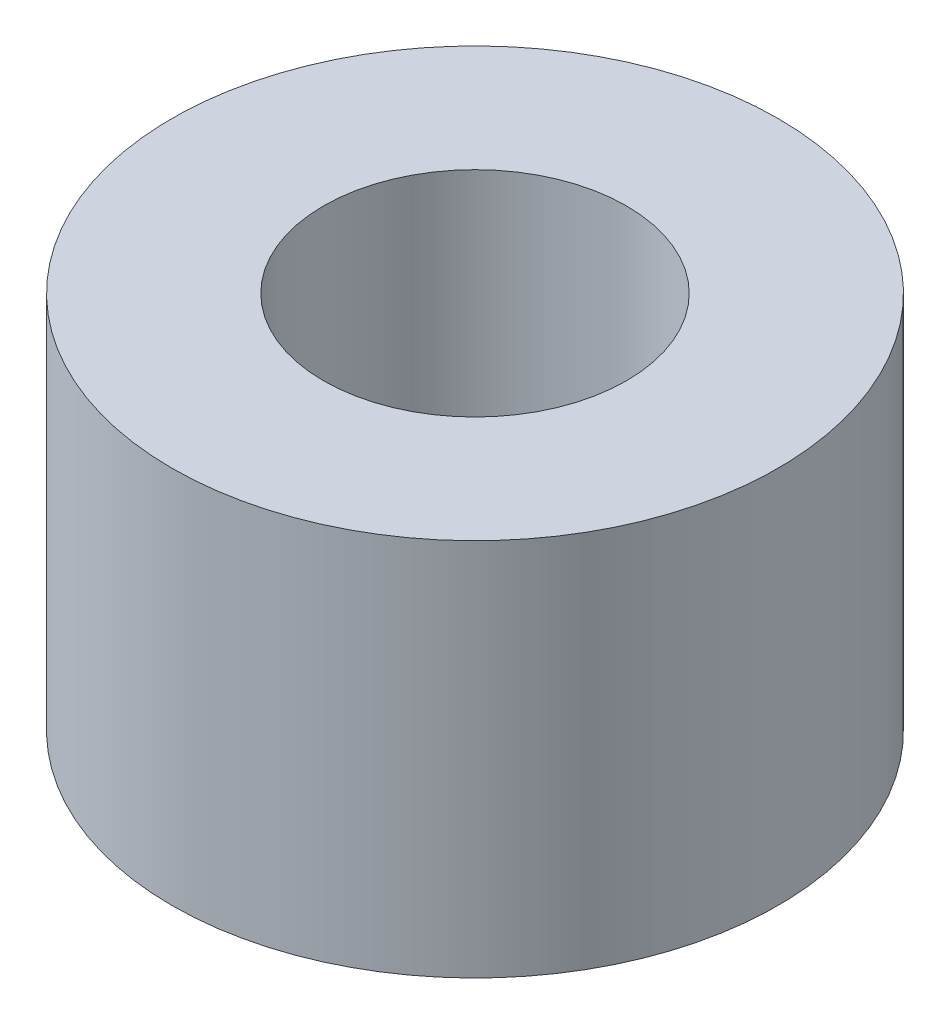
ISO-10303-21;
HEADER;
FILE_DESCRIPTION(('STEP AP214'),'2;1');
FILE_NAME('part.step','',(''),(''),'','','');
FILE_SCHEMA(('AUTOMOTIVE_DESIGN { 1 0 10303 214 1 1 1 1 }'));
ENDSEC;
DATA;
#1=APPLICATION_CONTEXT('core data for automotive mechanical design processes');
#2=APPLICATION_PROTOCOL_DEFINITION('international standard','automotive_design',2000,#1);
#3=PRODUCT_CONTEXT('',#1,'mechanical');
#4=PRODUCT('Part','Part','',(#3));
#5=PRODUCT_RELATED_PRODUCT_CATEGORY('part','',(#4));
#6=PRODUCT_DEFINITION_FORMATION('','',#4);
#7=PRODUCT_DEFINITION_CONTEXT('part definition',#1,'design');
#8=PRODUCT_DEFINITION('design','',#6,#7);
#9=PRODUCT_DEFINITION_SHAPE('','',#8);
#10=(LENGTH_UNIT() NAMED_UNIT(*) SI_UNIT(.MILLI.,.METRE.));
#11=(NAMED_UNIT(*) PLANE_ANGLE_UNIT() SI_UNIT($,.RADIAN.));
#12=(NAMED_UNIT(*) SI_UNIT($,.STERADIAN.) SOLID_ANGLE_UNIT());
#13=UNCERTAINTY_MEASURE_WITH_UNIT(LENGTH_MEASURE(1.E-05),#10,'distance_accuracy_value','');
#14=(GEOMETRIC_REPRESENTATION_CONTEXT(3) GLOBAL_UNCERTAINTY_ASSIGNED_CONTEXT((#13)) GLOBAL_UNIT_ASSIGNED_CONTEXT((#10,
#11,#12)) REPRESENTATION_CONTEXT('',''));
#15=CARTESIAN_POINT('',(0.,0.,0.));
#16=DIRECTION('',(0.,0.,1.));
#17=DIRECTION('',(1.,0.,0.));
#18=AXIS2_PLACEMENT_3D('',#15,#16,#17);
#19=CARTESIAN_POINT('',(0.,3.175,0.));
#20=DIRECTION('',(0.,1.,0.));
#21=DIRECTION('',(0.,0.,1.));
#22=AXIS2_PLACEMENT_3D('',#19,#20,#21);
#23=PLANE('',#22);
#24=CARTESIAN_POINT('',(0.,3.175,0.));
#25=DIRECTION('',(0.,1.,0.));
#26=DIRECTION('',(0.,0.,1.));
#27=AXIS2_PLACEMENT_3D('',#24,#25,#26);
#28=CIRCLE('',#27,2.54);
#29=CARTESIAN_POINT('',(0.,3.175,2.54));
#30=VERTEX_POINT('',#29);
#31=EDGE_CURVE('E10',#30,#30,#28,.T.);
#32=ORIENTED_EDGE('',*,*,#31,.T.);
#33=EDGE_LOOP('',(#32));
#34=FACE_BOUND('',#33,.T.);
#35=CARTESIAN_POINT('',(0.,3.175,0.));
#36=DIRECTION('',(0.,1.,0.));
#37=DIRECTION('',(0.,0.,1.));
#38=AXIS2_PLACEMENT_3D('',#35,#36,#37);
#39=CIRCLE('',#38,1.27);
#40=CARTESIAN_POINT('',(0.,3.175,1.27));
#41=VERTEX_POINT('',#40);
#42=EDGE_CURVE('E43',#41,#41,#39,.T.);
#43=ORIENTED_EDGE('',*,*,#42,.F.);
#44=EDGE_LOOP('',(#43));
#45=FACE_BOUND('',#44,.T.);
#46=ADVANCED_FACE('F32',(#34,#45),#23,.T.);
#47=CARTESIAN_POINT('',(0.,0.,0.));
#48=DIRECTION('',(0.,1.,0.));
#49=DIRECTION('',(0.,0.,1.));
#50=AXIS2_PLACEMENT_3D('',#47,#48,#49);
#51=PLANE('',#50);
#52=CARTESIAN_POINT('',(0.,0.,0.));
#53=DIRECTION('',(0.,1.,0.));
#54=DIRECTION('',(0.,0.,1.));
#55=AXIS2_PLACEMENT_3D('',#52,#53,#54);
#56=CIRCLE('',#55,2.54);
#57=CARTESIAN_POINT('',(0.,0.,2.54));
#58=VERTEX_POINT('',#57);
#59=EDGE_CURVE('E36',#58,#58,#56,.T.);
#60=ORIENTED_EDGE('',*,*,#59,.F.);
#61=EDGE_LOOP('',(#60));
#62=FACE_BOUND('',#61,.T.);
#63=CARTESIAN_POINT('',(0.,0.,0.));
#64=DIRECTION('',(0.,1.,0.));
#65=DIRECTION('',(0.,0.,1.));
#66=AXIS2_PLACEMENT_3D('',#63,#64,#65);
#67=CIRCLE('',#66,1.27);
#68=CARTESIAN_POINT('',(0.,0.,1.27));
#69=VERTEX_POINT('',#68);
#70=EDGE_CURVE('E45',#69,#69,#67,.T.);
#71=ORIENTED_EDGE('',*,*,#70,.T.);
#72=EDGE_LOOP('',(#71));
#73=FACE_BOUND('',#72,.T.);
#74=ADVANCED_FACE('F55',(#62,#73),#51,.F.);
#75=CARTESIAN_POINT('',(0.,3.175,0.));
#76=DIRECTION('',(0.,-1.,0.));
#77=DIRECTION('',(0.,0.,-1.));
#78=AXIS2_PLACEMENT_3D('',#75,#76,#77);
#79=CYLINDRICAL_SURFACE('',#78,2.54);
#80=ORIENTED_EDGE('',*,*,#31,.F.);
#81=EDGE_LOOP('',(#80));
#82=FACE_BOUND('',#81,.T.);
#83=ORIENTED_EDGE('',*,*,#59,.T.);
#84=EDGE_LOOP('',(#83));
#85=FACE_BOUND('',#84,.T.);
#86=ADVANCED_FACE('F34',(#82,#85),#79,.T.);
#87=CARTESIAN_POINT('',(0.,3.175,0.));
#88=DIRECTION('',(0.,-1.,0.));
#89=DIRECTION('',(0.,0.,-1.));
#90=AXIS2_PLACEMENT_3D('',#87,#88,#89);
#91=CYLINDRICAL_SURFACE('',#90,1.27);
#92=ORIENTED_EDGE('',*,*,#42,.T.);
#93=EDGE_LOOP('',(#92));
#94=FACE_BOUND('',#93,.T.);
#95=ORIENTED_EDGE('',*,*,#70,.F.);
#96=EDGE_LOOP('',(#95));
#97=FACE_BOUND('',#96,.T.);
#98=ADVANCED_FACE('F51',(#94,#97),#91,.F.);
#99=CLOSED_SHELL('',(#46,#74,#86,#98));
#100=MANIFOLD_SOLID_BREP('B2',#99);
#101=ADVANCED_BREP_SHAPE_REPRESENTATION('',(#18,#100),#14);
#102=SHAPE_DEFINITION_REPRESENTATION(#9,#101);
ENDSEC;
END-ISO-10303-21;
